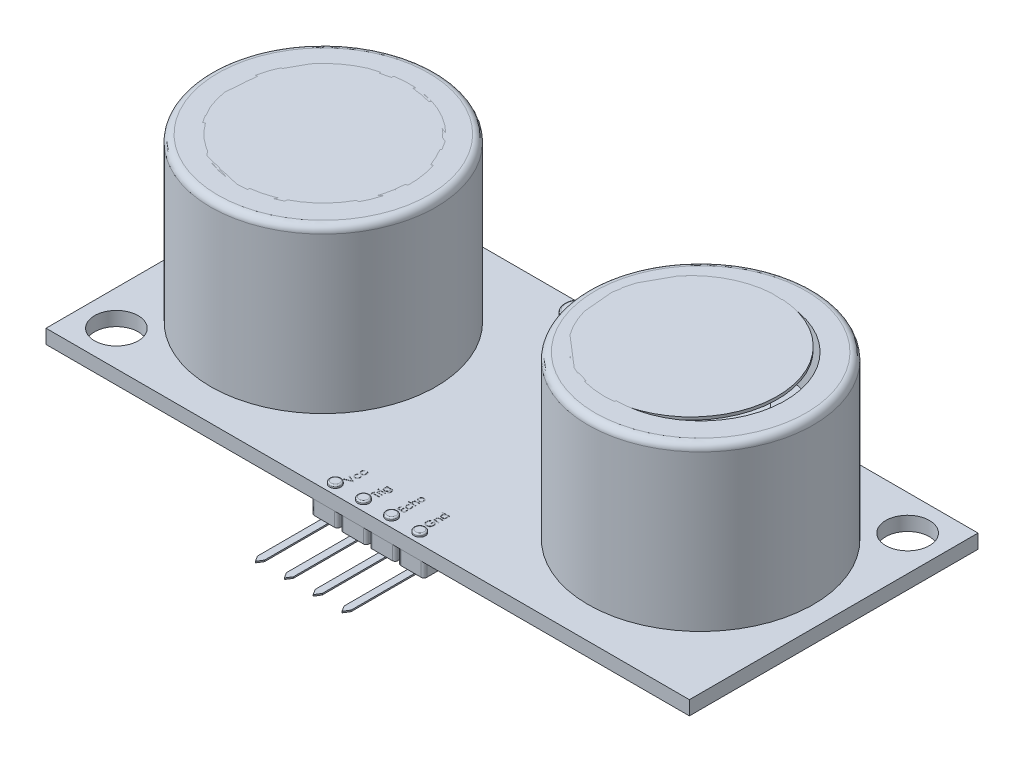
from build123d import *

# Parameters (mm, degrees)
SKETCH1_W              = 45.7
SKETCH1_H              = 20.5
SKETCH1_R              = 1.55
BOSS_EXTRUDE1_DEPTH    = 1
SKETCH2_R              = 8
SKETCH2_R_2            = 6
BOSS_EXTRUDE2_DEPTH    = 11.54
BOSS_EXTRUDE2_2_DEPTH  = 11.54
FILLET1_R              = 0.5
FILLET2_R              = 0.5
SKETCH3_R              = 6
BOSS_EXTRUDE3_DEPTH    = 7
BOSS_EXTRUDE3_2_DEPTH  = 7
LPATTERN2_COUNT        = 2
LPATTERN2_PITCH        = 25.4
SKETCH6_R              = 6.15
BOSS_EXTRUDE4_DEPTH    = 0.2
BOSS_EXTRUDE4_2_DEPTH  = 0.2
BOSS_EXTRUDE10_DEPTH   = 1
BOSS_EXTRUDE10_2_DEPTH = 1
BOSS_EXTRUDE10_3_DEPTH = 1
BOSS_EXTRUDE10_4_DEPTH = 1
SKETCH13_R             = 0.4
BOSS_EXTRUDE8_DEPTH    = 0.2
BOSS_EXTRUDE8_2_DEPTH  = 0.2
BOSS_EXTRUDE8_3_DEPTH  = 0.2
BOSS_EXTRUDE8_4_DEPTH  = 0.2
FILLET3_R              = 0.1
FILLET4_R              = 0.1
FILLET5_R              = 0.1
FILLET6_R              = 0.1
SKETCH15_W             = 0.365384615
SKETCH15_H             = 0.044871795
CUT_EXTRUDE5_DEPTH     = 0.01
BOSS_EXTRUDE11_DEPTH   = 0.1
BOSS_EXTRUDE11_2_DEPTH = 0.1
BOSS_EXTRUDE11_3_DEPTH = 0.1
BOSS_EXTRUDE11_4_DEPTH = 0.1
BOSS_EXTRUDE13_DEPTH   = 0.5
BOSS_EXTRUDE14_DEPTH   = 1.5
FILLET7_R              = 0.1


with BuildPart() as part:
    # Sketch1 → Boss-Extrude1 (new body)
    with BuildSketch(Plane(origin=(0, 0, 0), x_dir=(1, 0, 0), z_dir=(0, 1, 0))):
        Rectangle(SKETCH1_W, SKETCH1_H)
        with Locations(Location((20.35, 7.75, 0), (0, 0, 270))):
            Circle(SKETCH1_R, mode=Mode.SUBTRACT)
        with Locations(Location((-20.35, -7.75, 0), (0, 0, 270))):
            Circle(SKETCH1_R, mode=Mode.SUBTRACT)
    extrude(amount=BOSS_EXTRUDE1_DEPTH)

    # Sketch15 → Cut-Extrude5 (cut)
    # profile 1 of 15: a face of its own
    with BuildSketch(Plane(origin=(0, 1, 0), x_dir=(1, 0, 0), z_dir=(0, 1, 0))):
        with BuildLine():
            Line((-2.771008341, -7.673076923), (-2.747671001, -7.710637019))
            add(Edge.make_bspline(
                [(-2.747671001, -7.710637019), (-2.752789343, -7.714755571), (-2.76286393, -7.722862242), (-2.775865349, -7.736939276), (-2.787032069, -7.751940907), (-2.796132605, -7.768123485), (-2.803164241, -7.785464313), (-2.808139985, -7.803895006), (-2.811240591, -7.823412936), (-2.811592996, -7.836793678), (-2.811773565, -7.84364984)],
                knots=[0, 0, 0, 0, 1.026593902, 2.0206758, 2.988051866, 3.946915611, 4.916868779, 5.907761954, 6.927957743, 8, 8, 8, 8], degree=3))
            add(Edge.make_bspline(
                [(-2.811773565, -7.84364984), (-2.811622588, -7.849129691), (-2.811325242, -7.859922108), (-2.8094666, -7.875765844), (-2.80608917, -7.890857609), (-2.801639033, -7.905291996), (-2.795674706, -7.918966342), (-2.78841617, -7.931916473), (-2.779980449, -7.944257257), (-2.770207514, -7.955631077), (-2.759579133, -7.966035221), (-2.748185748, -7.975049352), (-2.736368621, -7.982897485), (-2.723832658, -7.989055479), (-2.71086465, -7.994094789), (-2.697219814, -7.997410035), (-2.683072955, -7.999619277), (-2.673427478, -7.999872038), (-2.668544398, -8)],
                knots=[0, 0, 0, 0, 1.112346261, 2.190735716, 3.231507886, 4.247384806, 5.251966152, 6.253067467, 7.256802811, 8.280671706, 9.291813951, 10.270744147, 11.225547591, 12.165006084, 13.100104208, 14.043489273, 15.009504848, 16, 16, 16, 16], degree=3))
            add(Edge.make_bspline(
                [(-2.668544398, -8), (-2.662149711, -7.999741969), (-2.649413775, -7.999228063), (-2.630645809, -7.995319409), (-2.612533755, -7.988779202), (-2.595175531, -7.979943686), (-2.579092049, -7.968728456), (-2.564665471, -7.955562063), (-2.552177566, -7.940430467), (-2.541824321, -7.923468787), (-2.533501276, -7.905074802), (-2.527571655, -7.88544765), (-2.523992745, -7.86474768), (-2.523541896, -7.850575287), (-2.523312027, -7.843349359)],
                knots=[0, 0, 0, 0, 0.96628757, 1.924499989, 2.884001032, 3.87047137, 4.860396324, 5.839257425, 6.814467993, 7.816059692, 8.834901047, 9.858382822, 10.908076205, 12, 12, 12, 12], degree=3))
            add(Edge.make_bspline(
                [(-2.523312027, -7.843349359), (-2.523497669, -7.83672719), (-2.523862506, -7.82371287), (-2.526938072, -7.804688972), (-2.531972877, -7.786577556), (-2.53899397, -7.769379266), (-2.548069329, -7.753125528), (-2.559263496, -7.73792136), (-2.572254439, -7.723464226), (-2.582299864, -7.714964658), (-2.587414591, -7.710637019)],
                knots=[0, 0, 0, 0, 1.039848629, 2.043578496, 3.018386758, 3.987534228, 4.954977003, 5.934852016, 6.948509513, 8, 8, 8, 8], degree=3))
            Line((-2.587414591, -7.710637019), (-2.562775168, -7.673076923))
            add(Edge.make_bspline(
                [(-2.562775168, -7.673076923), (-2.559505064, -7.675303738), (-2.55297571, -7.679749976), (-2.543769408, -7.687182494), (-2.535152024, -7.695199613), (-2.527135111, -7.703770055), (-2.519526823, -7.712781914), (-2.512690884, -7.722543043), (-2.506243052, -7.732738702), (-2.500441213, -7.743488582), (-2.495226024, -7.754681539), (-2.490741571, -7.766301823), (-2.486888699, -7.778298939), (-2.483826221, -7.790686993), (-2.481381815, -7.803490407), (-2.479759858, -7.816676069), (-2.478549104, -7.830239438), (-2.478476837, -7.839406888), (-2.478440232, -7.844050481)],
                knots=[0, 0, 0, 0, 0.954134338, 1.905101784, 2.851144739, 3.791306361, 4.734911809, 5.6936923, 6.663572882, 7.643865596, 8.638447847, 9.640600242, 10.646758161, 11.676244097, 12.717260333, 13.78922464, 14.880174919, 16, 16, 16, 16], degree=3))
            add(Edge.make_bspline(
                [(-2.478440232, -7.844050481), (-2.478567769, -7.851137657), (-2.478817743, -7.865028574), (-2.481558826, -7.885361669), (-2.485706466, -7.904787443), (-2.491608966, -7.923340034), (-2.499403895, -7.940906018), (-2.508707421, -7.957631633), (-2.519826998, -7.973344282), (-2.532498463, -7.987940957), (-2.546251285, -8.001289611), (-2.561005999, -8.01290504), (-2.576436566, -8.022748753), (-2.592640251, -8.030857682), (-2.60955061, -8.037198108), (-2.627270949, -8.041563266), (-2.645650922, -8.044379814), (-2.658184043, -8.044706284), (-2.664537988, -8.044871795)],
                knots=[0, 0, 0, 0, 1.113096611, 2.181677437, 3.217994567, 4.231807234, 5.234933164, 6.233258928, 7.234764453, 8.254006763, 9.267004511, 10.242118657, 11.199842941, 12.138404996, 13.084707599, 14.031460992, 15.002005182, 16, 16, 16, 16], degree=3))
            add(Edge.make_bspline(
                [(-2.664537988, -8.044871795), (-2.668849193, -8.044808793), (-2.677424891, -8.044683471), (-2.690152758, -8.043246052), (-2.702711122, -8.041389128), (-2.714940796, -8.038242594), (-2.727027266, -8.034608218), (-2.738824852, -8.029968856), (-2.750388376, -8.024526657), (-2.761688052, -8.018347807), (-2.772537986, -8.011392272), (-2.78278851, -8.003694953), (-2.792562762, -7.995545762), (-2.801523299, -7.986563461), (-2.810028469, -7.977129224), (-2.817851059, -7.966976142), (-2.825014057, -7.956162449), (-2.831649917, -7.944850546), (-2.837558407, -7.933047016), (-2.84264887, -7.920823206), (-2.846999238, -7.908252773), (-2.850443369, -7.895315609), (-2.853331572, -7.882097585), (-2.855148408, -7.868494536), (-2.856432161, -7.854558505), (-2.856573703, -7.84512193), (-2.85664536, -7.840344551)],
                knots=[0, 0, 0, 0, 0.990994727, 1.971252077, 2.943264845, 3.907940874, 4.872158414, 5.844625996, 6.82015047, 7.809835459, 8.804511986, 9.781214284, 10.756496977, 11.728388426, 12.696359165, 13.676225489, 14.672885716, 15.677705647, 16.690706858, 17.706033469, 18.721040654, 19.747369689, 20.783475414, 21.830280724, 22.901553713, 24, 24, 24, 24], degree=3))
            add(Edge.make_bspline(
                [(-2.85664536, -7.840344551), (-2.856513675, -7.834361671), (-2.856250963, -7.822425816), (-2.854039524, -7.804720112), (-2.850706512, -7.787274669), (-2.84576471, -7.770398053), (-2.839794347, -7.754285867), (-2.833049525, -7.739243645), (-2.825383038, -7.725498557), (-2.816841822, -7.712929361), (-2.807112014, -7.701539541), (-2.796292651, -7.691037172), (-2.784305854, -7.681353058), (-2.775477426, -7.675858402), (-2.771008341, -7.673076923)],
                knots=[0, 0, 0, 0, 1.095139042, 2.184804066, 3.262657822, 4.34424993, 5.400369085, 6.407210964, 7.359649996, 8.278719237, 9.185177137, 10.097389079, 11.036869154, 12, 12, 12, 12], degree=3))
        make_face()
    # profile 2 of 15: a face of its own
    with BuildSketch(Plane(origin=(0, 1, 0), x_dir=(1, 0, 0), z_dir=(0, 1, 0))):
        with BuildLine():
            Line((-2.771008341, -8.121794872), (-2.747671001, -8.159354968))
            add(Edge.make_bspline(
                [(-2.747671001, -8.159354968), (-2.752789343, -8.16347352), (-2.76286393, -8.171580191), (-2.775865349, -8.185657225), (-2.787032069, -8.200658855), (-2.796132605, -8.216841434), (-2.803164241, -8.234182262), (-2.808139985, -8.252612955), (-2.811240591, -8.272130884), (-2.811592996, -8.285511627), (-2.811773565, -8.292367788)],
                knots=[0, 0, 0, 0, 1.026593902, 2.0206758, 2.988051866, 3.946915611, 4.916868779, 5.907761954, 6.927957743, 8, 8, 8, 8], degree=3))
            add(Edge.make_bspline(
                [(-2.811773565, -8.292367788), (-2.811622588, -8.297847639), (-2.811325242, -8.308640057), (-2.8094666, -8.324483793), (-2.80608917, -8.339575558), (-2.801639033, -8.354009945), (-2.795674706, -8.36768429), (-2.78841617, -8.380634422), (-2.779980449, -8.392975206), (-2.770207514, -8.404349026), (-2.759579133, -8.41475317), (-2.748185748, -8.423767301), (-2.736368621, -8.431615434), (-2.723832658, -8.437773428), (-2.71086465, -8.442812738), (-2.697219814, -8.446127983), (-2.683072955, -8.448337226), (-2.673427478, -8.448589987), (-2.668544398, -8.448717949)],
                knots=[0, 0, 0, 0, 1.112346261, 2.190735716, 3.231507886, 4.247384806, 5.251966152, 6.253067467, 7.256802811, 8.280671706, 9.291813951, 10.270744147, 11.225547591, 12.165006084, 13.100104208, 14.043489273, 15.009504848, 16, 16, 16, 16], degree=3))
            add(Edge.make_bspline(
                [(-2.668544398, -8.448717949), (-2.662149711, -8.448459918), (-2.649413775, -8.447946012), (-2.630645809, -8.444037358), (-2.612533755, -8.437497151), (-2.595175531, -8.428661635), (-2.579092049, -8.417446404), (-2.564665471, -8.404280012), (-2.552177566, -8.389148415), (-2.541824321, -8.372186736), (-2.533501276, -8.35379275), (-2.527571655, -8.334165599), (-2.523992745, -8.313465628), (-2.523541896, -8.299293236), (-2.523312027, -8.292067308)],
                knots=[0, 0, 0, 0, 0.96628757, 1.924499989, 2.884001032, 3.87047137, 4.860396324, 5.839257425, 6.814467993, 7.816059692, 8.834901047, 9.858382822, 10.908076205, 12, 12, 12, 12], degree=3))
            add(Edge.make_bspline(
                [(-2.523312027, -8.292067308), (-2.523497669, -8.285445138), (-2.523862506, -8.272430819), (-2.526938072, -8.253406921), (-2.531972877, -8.235295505), (-2.53899397, -8.218097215), (-2.548069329, -8.201843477), (-2.559263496, -8.186639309), (-2.572254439, -8.172182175), (-2.582299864, -8.163682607), (-2.587414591, -8.159354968)],
                knots=[0, 0, 0, 0, 1.039848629, 2.043578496, 3.018386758, 3.987534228, 4.954977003, 5.934852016, 6.948509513, 8, 8, 8, 8], degree=3))
            Line((-2.587414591, -8.159354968), (-2.562775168, -8.121794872))
            add(Edge.make_bspline(
                [(-2.562775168, -8.121794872), (-2.559505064, -8.124021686), (-2.55297571, -8.128467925), (-2.543769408, -8.135900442), (-2.535152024, -8.143917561), (-2.527135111, -8.152488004), (-2.519526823, -8.161499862), (-2.512690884, -8.171260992), (-2.506243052, -8.181456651), (-2.500441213, -8.192206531), (-2.495226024, -8.203399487), (-2.490741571, -8.215019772), (-2.486888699, -8.227016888), (-2.483826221, -8.239404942), (-2.481381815, -8.252208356), (-2.479759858, -8.265394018), (-2.478549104, -8.278957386), (-2.478476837, -8.288124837), (-2.478440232, -8.292768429)],
                knots=[0, 0, 0, 0, 0.954134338, 1.905101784, 2.851144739, 3.791306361, 4.734911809, 5.6936923, 6.663572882, 7.643865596, 8.638447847, 9.640600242, 10.646758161, 11.676244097, 12.717260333, 13.78922464, 14.880174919, 16, 16, 16, 16], degree=3))
            add(Edge.make_bspline(
                [(-2.478440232, -8.292768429), (-2.478567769, -8.299855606), (-2.478817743, -8.313746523), (-2.481558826, -8.334079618), (-2.485706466, -8.353505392), (-2.491608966, -8.372057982), (-2.499403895, -8.389623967), (-2.508707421, -8.406349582), (-2.519826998, -8.42206223), (-2.532498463, -8.436658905), (-2.546251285, -8.45000756), (-2.561005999, -8.461622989), (-2.576436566, -8.471466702), (-2.592640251, -8.479575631), (-2.60955061, -8.485916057), (-2.627270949, -8.490281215), (-2.645650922, -8.493097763), (-2.658184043, -8.493424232), (-2.664537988, -8.493589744)],
                knots=[0, 0, 0, 0, 1.113096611, 2.181677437, 3.217994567, 4.231807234, 5.234933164, 6.233258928, 7.234764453, 8.254006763, 9.267004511, 10.242118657, 11.199842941, 12.138404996, 13.084707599, 14.031460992, 15.002005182, 16, 16, 16, 16], degree=3))
            add(Edge.make_bspline(
                [(-2.664537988, -8.493589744), (-2.668849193, -8.493526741), (-2.677424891, -8.493401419), (-2.690152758, -8.491964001), (-2.702711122, -8.490107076), (-2.714940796, -8.486960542), (-2.727027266, -8.483326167), (-2.738824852, -8.478686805), (-2.750388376, -8.473244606), (-2.761688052, -8.467065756), (-2.772537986, -8.460110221), (-2.78278851, -8.452412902), (-2.792562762, -8.444263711), (-2.801523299, -8.435281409), (-2.810028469, -8.425847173), (-2.817851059, -8.415694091), (-2.825014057, -8.404880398), (-2.831649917, -8.393568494), (-2.837558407, -8.381764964), (-2.84264887, -8.369541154), (-2.846999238, -8.356970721), (-2.850443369, -8.344033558), (-2.853331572, -8.330815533), (-2.855148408, -8.317212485), (-2.856432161, -8.303276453), (-2.856573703, -8.293839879), (-2.85664536, -8.2890625)],
                knots=[0, 0, 0, 0, 0.990994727, 1.971252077, 2.943264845, 3.907940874, 4.872158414, 5.844625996, 6.82015047, 7.809835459, 8.804511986, 9.781214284, 10.756496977, 11.728388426, 12.696359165, 13.676225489, 14.672885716, 15.677705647, 16.690706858, 17.706033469, 18.721040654, 19.747369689, 20.783475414, 21.830280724, 22.901553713, 24, 24, 24, 24], degree=3))
            add(Edge.make_bspline(
                [(-2.85664536, -8.2890625), (-2.856513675, -8.28307962), (-2.856250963, -8.271143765), (-2.854039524, -8.25343806), (-2.850706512, -8.235992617), (-2.84576471, -8.219116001), (-2.839794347, -8.203003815), (-2.833049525, -8.187961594), (-2.825383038, -8.174216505), (-2.816841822, -8.161647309), (-2.807112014, -8.150257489), (-2.796292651, -8.139755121), (-2.784305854, -8.130071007), (-2.775477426, -8.124576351), (-2.771008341, -8.121794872)],
                knots=[0, 0, 0, 0, 1.095139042, 2.184804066, 3.262657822, 4.34424993, 5.400369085, 6.407210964, 7.359649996, 8.278719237, 9.185177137, 10.097389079, 11.036869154, 12, 12, 12, 12], degree=3))
        make_face()
    # profile 3 of 15: a face of its own
    with BuildSketch(Plane(origin=(0, 1, 0), x_dir=(1, 0, 0), z_dir=(0, 1, 0))):
        Polygon((-2.984850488, -8.993589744), (-2.984850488, -8.945512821), (-2.590820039, -8.778846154), (-2.984850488, -8.612179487), (-2.984850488, -8.564102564), (-2.484850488, -8.775641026), (-2.484850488, -8.782051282), align=None)
    # profile 4 of 15: a face of its own
    with BuildSketch(Plane(origin=(0, 1, 0), x_dir=(1, 0, 0), z_dir=(0, 1, 0))):
        with BuildLine():
            Line((-0.997671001, -7.923076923), (-0.997671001, -7.878205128))
            Line((-0.997671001, -7.878205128), (-0.707707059, -7.878205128))
            add(Edge.make_bspline(
                [(-0.707707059, -7.878205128), (-0.701530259, -7.878244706), (-0.689607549, -7.8783211), (-0.672367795, -7.878871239), (-0.656444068, -7.880031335), (-0.641763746, -7.881346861), (-0.628394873, -7.883239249), (-0.616297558, -7.885550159), (-0.605460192, -7.888155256), (-0.598785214, -7.890443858), (-0.595627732, -7.891526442)],
                knots=[0, 0, 0, 0, 1.307562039, 2.523909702, 3.650326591, 4.686913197, 5.643429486, 6.506965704, 7.293745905, 8, 8, 8, 8], degree=3))
            add(Edge.make_bspline(
                [(-0.595627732, -7.891526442), (-0.591523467, -7.893124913), (-0.583437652, -7.89627406), (-0.571975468, -7.902171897), (-0.561183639, -7.908777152), (-0.551119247, -7.916319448), (-0.54184421, -7.924773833), (-0.533128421, -7.933892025), (-0.525299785, -7.943993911), (-0.518264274, -7.954902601), (-0.511803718, -7.966397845), (-0.50629187, -7.978566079), (-0.501694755, -7.991341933), (-0.497912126, -8.004666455), (-0.494860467, -8.018538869), (-0.492824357, -8.033005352), (-0.49145333, -8.048017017), (-0.491325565, -8.058223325), (-0.491260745, -8.063401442)],
                knots=[0, 0, 0, 0, 0.98202571, 1.934689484, 2.871054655, 3.802072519, 4.735470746, 5.668036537, 6.612630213, 7.581518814, 8.561763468, 9.551722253, 10.55777311, 11.588015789, 12.63986657, 13.723744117, 14.845153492, 16, 16, 16, 16], degree=3))
            add(Edge.make_bspline(
                [(-0.491260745, -8.063401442), (-0.491398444, -8.070954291), (-0.491667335, -8.085703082), (-0.494237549, -8.107250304), (-0.498383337, -8.127647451), (-0.504290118, -8.146745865), (-0.51159439, -8.164353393), (-0.519961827, -8.180371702), (-0.529561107, -8.194653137), (-0.540489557, -8.207527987), (-0.553484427, -8.219148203), (-0.56879853, -8.230080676), (-0.586665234, -8.240603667), (-0.599778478, -8.246770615), (-0.60664536, -8.25)],
                knots=[0, 0, 0, 0, 1.157856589, 2.260999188, 3.322382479, 4.345906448, 5.321474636, 6.242187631, 7.112686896, 7.955149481, 8.825136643, 9.778649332, 10.836767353, 12, 12, 12, 12], degree=3))
            Line((-0.60664536, -8.25), (-0.60664536, -8.205128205))
            add(Edge.make_bspline(
                [(-0.60664536, -8.205128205), (-0.600917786, -8.201517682), (-0.589721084, -8.194459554), (-0.575209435, -8.181304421), (-0.562921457, -8.166781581), (-0.552951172, -8.15058289), (-0.545275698, -8.13259537), (-0.539944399, -8.112702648), (-0.536718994, -8.090850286), (-0.536333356, -8.075632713), (-0.536132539, -8.067708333)],
                knots=[0, 0, 0, 0, 0.997887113, 1.950746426, 2.877762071, 3.798308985, 4.747694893, 5.754452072, 6.830656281, 8, 8, 8, 8], degree=3))
            add(Edge.make_bspline(
                [(-0.536132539, -8.067708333), (-0.536335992, -8.059884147), (-0.536728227, -8.0447999), (-0.53994568, -8.023114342), (-0.545277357, -8.003286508), (-0.552935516, -7.98553539), (-0.562134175, -7.969971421), (-0.57230764, -7.956477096), (-0.583915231, -7.945633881), (-0.594592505, -7.938312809), (-0.604111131, -7.933766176), (-0.61230383, -7.930868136), (-0.621538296, -7.928530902), (-0.631836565, -7.926524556), (-0.643202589, -7.924934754), (-0.65567513, -7.923891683), (-0.669169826, -7.923151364), (-0.678525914, -7.92310231), (-0.683368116, -7.923076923)],
                knots=[0, 0, 0, 0, 1.570880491, 3.028500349, 4.391799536, 5.683507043, 6.897971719, 8.016608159, 9.065046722, 10.074948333, 10.602832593, 11.179761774, 11.817338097, 12.514350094, 13.286299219, 14.121078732, 15.027572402, 16, 16, 16, 16], degree=3))
            Line((-0.683368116, -7.923076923), (-0.702298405, -7.923076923))
            add(Edge.make_bspline(
                [(-0.702298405, -7.923076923), (-0.696880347, -7.927632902), (-0.686139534, -7.936664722), (-0.672040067, -7.9522204), (-0.660043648, -7.969318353), (-0.650065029, -7.987716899), (-0.642159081, -8.007141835), (-0.636430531, -8.027249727), (-0.632877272, -8.047984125), (-0.632484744, -8.062018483), (-0.632286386, -8.069110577)],
                knots=[0, 0, 0, 0, 1.012670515, 2.007528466, 2.995541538, 3.996581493, 4.997861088, 5.991949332, 6.98525577, 8, 8, 8, 8], degree=3))
            add(Edge.make_bspline(
                [(-0.632286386, -8.069110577), (-0.632374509, -8.073285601), (-0.632549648, -8.081583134), (-0.63361503, -8.093945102), (-0.635689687, -8.106068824), (-0.638346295, -8.11803153), (-0.641907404, -8.129749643), (-0.646087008, -8.14136357), (-0.651220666, -8.152704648), (-0.657000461, -8.163830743), (-0.663494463, -8.174480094), (-0.670510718, -8.184619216), (-0.67803427, -8.194185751), (-0.686133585, -8.203091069), (-0.694798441, -8.211322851), (-0.703936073, -8.218991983), (-0.713674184, -8.225971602), (-0.723835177, -8.232404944), (-0.734486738, -8.237984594), (-0.745397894, -8.242882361), (-0.756545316, -8.247140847), (-0.767966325, -8.250535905), (-0.779653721, -8.253128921), (-0.791588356, -8.255058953), (-0.803806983, -8.256153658), (-0.812038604, -8.256324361), (-0.816180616, -8.256410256)],
                knots=[0, 0, 0, 0, 1.028710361, 2.044481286, 3.053267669, 4.056977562, 5.061496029, 6.068537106, 7.095799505, 8.125955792, 9.155750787, 10.166547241, 11.162135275, 12.151998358, 13.129411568, 14.10464185, 15.088574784, 16.079052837, 17.065149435, 18.048153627, 19.024354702, 20.002874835, 20.980703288, 21.971932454, 22.97951087, 24, 24, 24, 24], degree=3))
            add(Edge.make_bspline(
                [(-0.816180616, -8.256410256), (-0.820323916, -8.25633609), (-0.828594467, -8.256188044), (-0.840862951, -8.254909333), (-0.852967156, -8.253085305), (-0.864782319, -8.250198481), (-0.876442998, -8.246723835), (-0.887863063, -8.242420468), (-0.899045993, -8.237246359), (-0.910000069, -8.231387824), (-0.920578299, -8.224804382), (-0.930624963, -8.217585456), (-0.94006613, -8.209722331), (-0.948997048, -8.201323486), (-0.957331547, -8.192286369), (-0.965049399, -8.182615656), (-0.972279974, -8.172406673), (-0.978867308, -8.16162778), (-0.984693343, -8.150445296), (-0.990009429, -8.139143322), (-0.994228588, -8.127572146), (-0.997946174, -8.115947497), (-1.000579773, -8.104064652), (-1.002611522, -8.09206931), (-1.003849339, -8.079920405), (-1.004003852, -8.071784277), (-1.004081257, -8.067708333)],
                knots=[0, 0, 0, 0, 1.008818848, 2.013730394, 3.001654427, 3.987803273, 4.973046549, 5.963777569, 6.957074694, 7.972068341, 8.987420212, 9.989399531, 10.982630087, 11.977756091, 12.973280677, 13.973972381, 14.989194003, 16.018387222, 17.047741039, 18.059210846, 19.057554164, 20.045176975, 21.029480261, 22.018708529, 23.007435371, 24, 24, 24, 24], degree=3))
            add(Edge.make_bspline(
                [(-1.004081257, -8.067708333), (-1.003887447, -8.060986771), (-1.003504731, -8.04771375), (-1.00050171, -8.028180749), (-0.995713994, -8.009331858), (-0.988854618, -7.991060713), (-0.979490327, -7.973218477), (-0.96715562, -7.955863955), (-0.951739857, -7.938946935), (-0.939918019, -7.928507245), (-0.933768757, -7.923076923)],
                knots=[0, 0, 0, 0, 0.96728863, 1.910097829, 2.838038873, 3.762875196, 4.71315279, 5.730631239, 6.819562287, 8, 8, 8, 8], degree=3))
            Line((-0.933768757, -7.923076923), (-0.997671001, -7.923076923))
        make_face()
        with BuildLine():
            add(Edge.make_bspline(
                [(-0.959209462, -8.064102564), (-0.958985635, -8.070663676), (-0.958542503, -8.083653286), (-0.954785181, -8.102700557), (-0.948838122, -8.121046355), (-0.940560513, -8.138509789), (-0.930099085, -8.15468857), (-0.917652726, -8.169167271), (-0.903392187, -8.181790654), (-0.887501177, -8.192471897), (-0.87033042, -8.201004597), (-0.852239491, -8.206965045), (-0.83354441, -8.210904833), (-0.820807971, -8.211325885), (-0.814377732, -8.211538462)],
                knots=[0, 0, 0, 0, 1.026191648, 2.031641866, 3.026511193, 4.038688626, 5.047555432, 6.033268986, 7.01798463, 8.019529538, 9.022150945, 10.008736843, 10.994672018, 12, 12, 12, 12], degree=3))
            add(Edge.make_bspline(
                [(-0.814377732, -8.211538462), (-0.809530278, -8.211434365), (-0.799996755, -8.211229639), (-0.786003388, -8.209275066), (-0.772655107, -8.206077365), (-0.759964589, -8.201659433), (-0.747930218, -8.19601418), (-0.736552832, -8.189051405), (-0.725826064, -8.18080999), (-0.71584043, -8.171403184), (-0.70674619, -8.161034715), (-0.698754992, -8.149789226), (-0.692219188, -8.137681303), (-0.686570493, -8.12500891), (-0.682444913, -8.111464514), (-0.679296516, -8.097243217), (-0.677495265, -8.082244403), (-0.677272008, -8.072019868), (-0.67715818, -8.066806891)],
                knots=[0, 0, 0, 0, 1.039710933, 2.044807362, 3.024849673, 3.981007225, 4.923240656, 5.871799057, 6.837597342, 7.820855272, 8.810901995, 9.792827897, 10.773995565, 11.758948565, 12.765014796, 13.806304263, 14.881544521, 16, 16, 16, 16], degree=3))
            add(Edge.make_bspline(
                [(-0.67715818, -8.066806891), (-0.677267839, -8.061526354), (-0.677482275, -8.05120032), (-0.679325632, -8.036118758), (-0.6823002, -8.021828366), (-0.686523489, -8.008342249), (-0.691912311, -7.995609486), (-0.698731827, -7.983773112), (-0.706498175, -7.972579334), (-0.715557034, -7.962385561), (-0.725540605, -7.953167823), (-0.736404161, -7.945134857), (-0.747984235, -7.938289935), (-0.760279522, -7.932621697), (-0.773385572, -7.928294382), (-0.787269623, -7.925391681), (-0.801865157, -7.923362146), (-0.811866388, -7.923173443), (-0.816981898, -7.923076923)],
                knots=[0, 0, 0, 0, 1.121943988, 2.193949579, 3.223793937, 4.220241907, 5.192961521, 6.155822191, 7.11847367, 8.083710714, 9.04790392, 10.001595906, 10.949595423, 11.902125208, 12.873731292, 13.87582262, 14.913508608, 16, 16, 16, 16], degree=3))
            add(Edge.make_bspline(
                [(-0.816981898, -7.923076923), (-0.82364145, -7.923268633), (-0.836651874, -7.923643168), (-0.85561197, -7.927166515), (-0.873457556, -7.93288198), (-0.890142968, -7.94081413), (-0.905435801, -7.950799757), (-0.918948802, -7.962944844), (-0.931054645, -7.976711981), (-0.941008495, -7.992437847), (-0.949122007, -8.009269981), (-0.955011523, -8.026960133), (-0.958478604, -8.045337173), (-0.958964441, -8.057811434), (-0.959209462, -8.064102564)],
                knots=[0, 0, 0, 0, 1.070678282, 2.091729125, 3.090678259, 4.078281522, 5.055707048, 6.018451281, 6.993304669, 7.996175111, 9.002951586, 9.993356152, 10.987991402, 12, 12, 12, 12], degree=3))
        make_face(mode=Mode.SUBTRACT)
    # profile 5 of 15: a face of its own
    with BuildSketch(Plane(origin=(0, 1, 0), x_dir=(1, 0, 0), z_dir=(0, 1, 0))):
        with BuildLine():
            add(Edge.make_bspline(
                [(-1.151517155, -8.368790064), (-1.15138799, -8.36600559), (-1.151135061, -8.360553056), (-1.148969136, -8.352668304), (-1.145297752, -8.34548873), (-1.140372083, -8.339120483), (-1.134579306, -8.333655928), (-1.127827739, -8.329830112), (-1.120533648, -8.327371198), (-1.115445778, -8.327074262), (-1.112855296, -8.326923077)],
                knots=[0, 0, 0, 0, 1.055194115, 2.066272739, 3.074728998, 4.095836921, 5.109056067, 6.073838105, 7.019297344, 8, 8, 8, 8], degree=3))
            add(Edge.make_bspline(
                [(-1.112855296, -8.326923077), (-1.11033206, -8.327077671), (-1.10534392, -8.327383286), (-1.098176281, -8.329828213), (-1.091518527, -8.333688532), (-1.085736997, -8.339116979), (-1.080814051, -8.345489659), (-1.077141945, -8.352668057), (-1.074976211, -8.360553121), (-1.074723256, -8.366005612), (-1.074594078, -8.368790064)],
                knots=[0, 0, 0, 0, 0.96129708, 1.900370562, 2.859976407, 3.87933698, 4.906634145, 5.921202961, 6.938410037, 8, 8, 8, 8], degree=3))
            add(Edge.make_bspline(
                [(-1.074594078, -8.368790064), (-1.074718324, -8.371542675), (-1.074960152, -8.376900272), (-1.07718444, -8.384666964), (-1.080815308, -8.391785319), (-1.085704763, -8.398165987), (-1.091554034, -8.403484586), (-1.098172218, -8.407355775), (-1.105344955, -8.409795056), (-1.110332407, -8.410101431), (-1.112855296, -8.41025641)],
                knots=[0, 0, 0, 0, 1.054934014, 2.053291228, 3.073705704, 4.106921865, 5.123545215, 6.088680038, 7.033164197, 8, 8, 8, 8], degree=3))
            add(Edge.make_bspline(
                [(-1.112855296, -8.41025641), (-1.115445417, -8.410104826), (-1.120532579, -8.409807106), (-1.127831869, -8.407353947), (-1.134543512, -8.403516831), (-1.140404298, -8.398162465), (-1.145296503, -8.391786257), (-1.148926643, -8.384666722), (-1.15115112, -8.376900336), (-1.151392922, -8.371542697), (-1.151517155, -8.368790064)],
                knots=[0, 0, 0, 0, 0.98631895, 1.937192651, 2.907499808, 3.917963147, 4.944918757, 5.95915025, 6.951458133, 8, 8, 8, 8], degree=3))
        make_face()
    # profile 6 of 15: a face of its own
    with BuildSketch(Plane(origin=(0, 1, 0), x_dir=(1, 0, 0), z_dir=(0, 1, 0))):
        with Locations((-0.814978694, -8.368589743)):
            Rectangle(SKETCH15_W, SKETCH15_H)
    # profile 7 of 15: a face of its own
    with BuildSketch(Plane(origin=(0, 1, 0), x_dir=(1, 0, 0), z_dir=(0, 1, 0))):
        with BuildLine():
            Line((-0.997671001, -8.608974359), (-0.997671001, -8.564102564))
            Line((-0.997671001, -8.564102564), (-0.943884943, -8.564102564))
            add(Edge.make_bspline(
                [(-0.943884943, -8.564102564), (-0.948895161, -8.560792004), (-0.958477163, -8.554460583), (-0.971132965, -8.543887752), (-0.98173113, -8.533173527), (-0.990069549, -8.522036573), (-0.996371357, -8.510586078), (-1.00079944, -8.498918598), (-1.003545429, -8.487005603), (-1.003902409, -8.478980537), (-1.004081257, -8.474959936)],
                knots=[0, 0, 0, 0, 1.280091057, 2.448164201, 3.510831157, 4.48793739, 5.405868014, 6.289422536, 7.142991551, 8, 8, 8, 8], degree=3))
            add(Edge.make_bspline(
                [(-1.004081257, -8.474959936), (-1.003911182, -8.471841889), (-1.003561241, -8.465426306), (-1.001102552, -8.455714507), (-0.99717712, -8.4457083), (-0.99348566, -8.439259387), (-0.991561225, -8.435897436)],
                knots=[0, 0, 0, 0, 0.901110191, 1.854092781, 2.881294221, 4, 4, 4, 4], degree=3))
            Line((-0.991561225, -8.435897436), (-0.952699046, -8.460536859))
            add(Edge.make_bspline(
                [(-0.952699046, -8.460536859), (-0.953661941, -8.462695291), (-0.9554897, -8.466792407), (-0.957652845, -8.472785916), (-0.958926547, -8.478311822), (-0.959119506, -8.48183233), (-0.959209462, -8.483473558)],
                knots=[0, 0, 0, 0, 1.180555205, 2.24091978, 3.179933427, 4, 4, 4, 4], degree=3))
            add(Edge.make_bspline(
                [(-0.959209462, -8.483473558), (-0.958971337, -8.487075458), (-0.958485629, -8.49442229), (-0.954612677, -8.505172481), (-0.948535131, -8.515697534), (-0.941614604, -8.523975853), (-0.934966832, -8.530408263), (-0.929148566, -8.535034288), (-0.922564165, -8.539186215), (-0.915468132, -8.543213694), (-0.907682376, -8.546955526), (-0.899194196, -8.550299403), (-0.890073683, -8.553426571), (-0.883731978, -8.555187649), (-0.880483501, -8.556089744)],
                knots=[0, 0, 0, 0, 1.125322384, 2.295331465, 3.535939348, 4.916963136, 5.656144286, 6.429838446, 7.238666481, 8.090384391, 8.983239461, 9.940052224, 10.944811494, 12, 12, 12, 12], degree=3))
            add(Edge.make_bspline(
                [(-0.880483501, -8.556089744), (-0.877586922, -8.556766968), (-0.871139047, -8.558274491), (-0.860370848, -8.559701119), (-0.847656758, -8.561167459), (-0.832982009, -8.562168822), (-0.81629019, -8.563114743), (-0.79765331, -8.563637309), (-0.777020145, -8.564085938), (-0.762628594, -8.564096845), (-0.75508286, -8.564102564)],
                knots=[0, 0, 0, 0, 0.566841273, 1.261806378, 2.068780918, 3.007109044, 4.065315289, 5.256255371, 6.561408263, 8, 8, 8, 8], degree=3))
            Line((-0.75508286, -8.564102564), (-0.632286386, -8.564102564))
            Line((-0.632286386, -8.564102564), (-0.632286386, -8.608974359))
            Line((-0.632286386, -8.608974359), (-0.997671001, -8.608974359))
        make_face()
    # profile 8 of 15: a face of its own
    with BuildSketch(Plane(origin=(0, 1, 0), x_dir=(1, 0, 0), z_dir=(0, 1, 0))):
        Polygon((-1.081004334, -8.935897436), (-1.132286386, -8.935897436), (-1.132286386, -8.673076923), (-1.081004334, -8.673076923), (-1.081004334, -8.782051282), (-0.632286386, -8.782051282), (-0.632286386, -8.826923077), (-1.081004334, -8.826923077), align=None)
    # profile 9 of 15: a face of its own
    with BuildSketch(Plane(origin=(0, 1, 0), x_dir=(1, 0, 0), z_dir=(0, 1, 0))):
        with BuildLine():
            add(Edge.make_bspline(
                [(0.848482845, -7.477363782), (0.84862883, -7.470507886), (0.84891507, -7.457065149), (0.85197435, -7.437378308), (0.856652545, -7.418586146), (0.863119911, -7.40061669), (0.871788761, -7.383700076), (0.882132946, -7.367589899), (0.894387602, -7.352330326), (0.903867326, -7.343184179), (0.908679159, -7.338541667)],
                knots=[0, 0, 0, 0, 1.054011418, 2.066658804, 3.057071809, 4.030435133, 4.997543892, 5.974964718, 6.972108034, 8, 8, 8, 8], degree=3))
            add(Edge.make_bspline(
                [(0.908679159, -7.338541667), (0.913281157, -7.334544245), (0.922396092, -7.326626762), (0.937175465, -7.316474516), (0.952481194, -7.307728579), (0.968516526, -7.300719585), (0.985141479, -7.295193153), (1.002413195, -7.291269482), (1.02029353, -7.288935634), (1.032436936, -7.288620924), (1.038587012, -7.288461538)],
                knots=[0, 0, 0, 0, 1.025258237, 2.030674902, 3.01204498, 3.988269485, 4.97094183, 5.956517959, 6.965070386, 8, 8, 8, 8], degree=3))
            add(Edge.make_bspline(
                [(1.038587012, -7.288461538), (1.044772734, -7.28860173), (1.056996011, -7.288878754), (1.074998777, -7.29149927), (1.09245518, -7.29557514), (1.109292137, -7.301408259), (1.125561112, -7.308887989), (1.141191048, -7.31801523), (1.156212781, -7.328854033), (1.170498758, -7.341140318), (1.18366536, -7.354719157), (1.195140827, -7.369450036), (1.204972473, -7.385043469), (1.212891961, -7.401706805), (1.219136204, -7.419287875), (1.223521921, -7.437824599), (1.22617359, -7.45728818), (1.2265141, -7.470577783), (1.226687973, -7.477363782)],
                knots=[0, 0, 0, 0, 0.998656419, 1.973391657, 2.932242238, 3.890759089, 4.846373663, 5.82037756, 6.809684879, 7.83454468, 8.860553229, 9.859544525, 10.845671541, 11.83227036, 12.833544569, 13.85385346, 14.904124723, 16, 16, 16, 16], degree=3))
            add(Edge.make_bspline(
                [(1.226687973, -7.477363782), (1.226513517, -7.484183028), (1.226171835, -7.497538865), (1.223532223, -7.517071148), (1.219138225, -7.535641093), (1.212871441, -7.553245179), (1.20497222, -7.569980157), (1.19517055, -7.585663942), (1.183661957, -7.600406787), (1.17049968, -7.6139885), (1.156212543, -7.626274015), (1.141191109, -7.637113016), (1.125561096, -7.646240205), (1.109292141, -7.653719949), (1.092455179, -7.659553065), (1.074998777, -7.663628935), (1.056996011, -7.666249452), (1.044772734, -7.666526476), (1.038587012, -7.666666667)],
                knots=[0, 0, 0, 0, 1.099876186, 2.154163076, 3.173186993, 4.173200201, 5.163417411, 6.152872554, 7.150605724, 8.17532212, 9.198891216, 10.186952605, 11.159729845, 12.11414092, 13.071450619, 14.029093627, 15.002601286, 16, 16, 16, 16], degree=3))
            add(Edge.make_bspline(
                [(1.038587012, -7.666666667), (1.032470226, -7.666506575), (1.020360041, -7.666189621), (1.002515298, -7.663852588), (0.985296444, -7.65997161), (0.968762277, -7.654368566), (0.952765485, -7.647372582), (0.937403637, -7.638714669), (0.922688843, -7.628464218), (0.913585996, -7.620577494), (0.90897964, -7.616586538)],
                knots=[0, 0, 0, 0, 1.031377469, 2.041950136, 3.029500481, 4.003457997, 4.981637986, 5.969878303, 6.97268806, 8, 8, 8, 8], degree=3))
            add(Edge.make_bspline(
                [(0.90897964, -7.616586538), (0.904126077, -7.611951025), (0.894580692, -7.602834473), (0.88236176, -7.587498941), (0.871802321, -7.571428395), (0.863305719, -7.554324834), (0.856614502, -7.53637014), (0.851962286, -7.517481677), (0.848926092, -7.497728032), (0.848632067, -7.484219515), (0.848482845, -7.477363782)],
                knots=[0, 0, 0, 0, 1.027980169, 2.021703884, 2.998553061, 3.971491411, 4.943284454, 5.930300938, 6.949603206, 8, 8, 8, 8], degree=3))
        make_face()
        with BuildLine():
            add(Edge.make_bspline(
                [(0.89335464, -7.477564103), (0.893492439, -7.482412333), (0.893764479, -7.491983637), (0.895833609, -7.506072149), (0.899111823, -7.519635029), (0.903769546, -7.532698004), (0.909783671, -7.545217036), (0.917170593, -7.557204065), (0.925832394, -7.568694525), (0.935755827, -7.579462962), (0.946594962, -7.589347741), (0.958147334, -7.597981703), (0.970235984, -7.605364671), (0.982879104, -7.6114035), (0.996119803, -7.616034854), (1.009880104, -7.619316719), (1.02420156, -7.621389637), (1.033939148, -7.62165833), (1.038887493, -7.621794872)],
                knots=[0, 0, 0, 0, 1.02155314, 2.01673505, 2.994700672, 3.958461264, 4.934171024, 5.916582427, 6.921469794, 7.962398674, 8.998583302, 10.009097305, 10.997513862, 11.97957236, 12.956600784, 13.948243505, 14.957359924, 16, 16, 16, 16], degree=3))
            add(Edge.make_bspline(
                [(1.038887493, -7.621794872), (1.045280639, -7.621565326), (1.05796984, -7.621109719), (1.076657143, -7.617404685), (1.094597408, -7.611206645), (1.111685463, -7.602837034), (1.127495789, -7.592350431), (1.141591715, -7.579995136), (1.153761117, -7.56590375), (1.16385838, -7.55024425), (1.171881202, -7.533336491), (1.17756677, -7.515442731), (1.181262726, -7.496779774), (1.18163008, -7.484025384), (1.181816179, -7.477564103)],
                knots=[0, 0, 0, 0, 1.016792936, 2.018143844, 3.017858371, 4.030088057, 5.03801393, 6.028138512, 7.003788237, 7.991172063, 8.984598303, 9.972568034, 10.972917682, 12, 12, 12, 12], degree=3))
            add(Edge.make_bspline(
                [(1.181816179, -7.477564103), (1.181628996, -7.471103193), (1.181259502, -7.458349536), (1.177585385, -7.439712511), (1.17185629, -7.421867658), (1.163867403, -7.40497746), (1.153722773, -7.389325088), (1.141660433, -7.375132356), (1.127458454, -7.362882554), (1.111664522, -7.352406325), (1.0946239, -7.343899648), (1.076653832, -7.337730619), (1.057970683, -7.334016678), (1.045280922, -7.333562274), (1.038887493, -7.333333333)],
                knots=[0, 0, 0, 0, 1.02726834, 2.027799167, 3.010890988, 4.004497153, 4.992059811, 5.971914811, 6.958719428, 7.966827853, 8.981595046, 9.981490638, 10.983022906, 12, 12, 12, 12], degree=3))
            add(Edge.make_bspline(
                [(1.038887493, -7.333333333), (1.033939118, -7.333469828), (1.024201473, -7.333738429), (1.009880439, -7.335812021), (0.996118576, -7.339091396), (0.982883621, -7.343731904), (0.970203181, -7.349743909), (0.958182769, -7.357268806), (0.946554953, -7.365867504), (0.935790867, -7.375871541), (0.925828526, -7.386628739), (0.917167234, -7.398123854), (0.909816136, -7.410093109), (0.903718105, -7.422575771), (0.899154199, -7.435640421), (0.89581468, -7.449184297), (0.893773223, -7.463212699), (0.89349506, -7.472749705), (0.89335464, -7.477564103)],
                knots=[0, 0, 0, 0, 1.042975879, 2.052417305, 3.044379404, 4.0217225, 5.00409729, 5.996508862, 7.007348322, 8.048612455, 9.089876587, 10.095087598, 11.077815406, 12.047498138, 13.018202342, 13.98964644, 14.985148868, 16, 16, 16, 16], degree=3))
        make_face(mode=Mode.SUBTRACT)
    # profile 10 of 15: a face of its own
    with BuildSketch(Plane(origin=(0, 1, 0), x_dir=(1, 0, 0), z_dir=(0, 1, 0))):
        with BuildLine():
            Line((0.707457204, -8.076923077), (0.707457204, -8.032051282))
            Line((0.707457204, -8.032051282), (0.923903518, -8.032051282))
            add(Edge.make_bspline(
                [(0.923903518, -8.032051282), (0.917883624, -8.027234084), (0.906162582, -8.017854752), (0.890858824, -8.00207567), (0.877623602, -7.985830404), (0.866947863, -7.968694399), (0.858596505, -7.950817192), (0.852836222, -7.932173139), (0.849163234, -7.912837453), (0.848711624, -7.899689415), (0.848482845, -7.893028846)],
                knots=[0, 0, 0, 0, 1.125633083, 2.191665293, 3.205031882, 4.182434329, 5.134135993, 6.080017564, 7.027370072, 8, 8, 8, 8], degree=3))
            add(Edge.make_bspline(
                [(0.848482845, -7.893028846), (0.848717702, -7.886263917), (0.849177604, -7.873016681), (0.853241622, -7.853801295), (0.859635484, -7.835744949), (0.86871391, -7.819113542), (0.879925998, -7.804086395), (0.893005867, -7.790933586), (0.90795539, -7.779992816), (0.921847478, -7.772662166), (0.934206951, -7.767861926), (0.94481292, -7.764826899), (0.956630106, -7.762252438), (0.96965371, -7.760009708), (0.983945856, -7.758514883), (0.999442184, -7.757314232), (1.016141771, -7.75646045), (1.027701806, -7.756427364), (1.033679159, -7.756410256)],
                knots=[0, 0, 0, 0, 1.235771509, 2.41991536, 3.57472251, 4.727526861, 5.870395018, 6.992794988, 8.106410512, 9.245194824, 9.854018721, 10.52826073, 11.259975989, 12.064917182, 12.943387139, 13.886414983, 14.90712766, 16, 16, 16, 16], degree=3))
            Line((1.033679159, -7.756410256), (1.220277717, -7.756410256))
            Line((1.220277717, -7.756410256), (1.220277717, -7.801282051))
            Line((1.220277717, -7.801282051), (1.048402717, -7.801282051))
            add(Edge.make_bspline(
                [(1.048402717, -7.801282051), (1.043428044, -7.801309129), (1.03391234, -7.801360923), (1.020288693, -7.80153424), (1.007965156, -7.801912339), (0.996916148, -7.802545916), (0.987156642, -7.803183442), (0.978670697, -7.804087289), (0.971511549, -7.805131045), (0.96720232, -7.806069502), (0.965269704, -7.806490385)],
                knots=[0, 0, 0, 0, 1.430934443, 2.737134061, 3.918973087, 4.976914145, 5.92044225, 6.731742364, 7.431207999, 8, 8, 8, 8], degree=3))
            add(Edge.make_bspline(
                [(0.965269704, -7.806490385), (0.959594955, -7.808114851), (0.948714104, -7.811229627), (0.933960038, -7.818613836), (0.921267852, -7.82762254), (0.91099197, -7.838786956), (0.902928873, -7.851717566), (0.897348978, -7.866556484), (0.893884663, -7.883153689), (0.893536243, -7.894846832), (0.89335464, -7.900941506)],
                knots=[0, 0, 0, 0, 1.090133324, 2.090238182, 3.036763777, 3.954757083, 4.878717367, 5.838952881, 6.873623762, 8, 8, 8, 8], degree=3))
            add(Edge.make_bspline(
                [(0.89335464, -7.900941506), (0.893421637, -7.904551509), (0.893554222, -7.911695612), (0.894919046, -7.922283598), (0.897074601, -7.932586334), (0.900258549, -7.942576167), (0.904129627, -7.952273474), (0.908880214, -7.961717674), (0.914624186, -7.970779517), (0.921088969, -7.979575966), (0.928240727, -7.987764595), (0.935790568, -7.995382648), (0.943829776, -8.002173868), (0.952229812, -8.008326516), (0.961105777, -8.013637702), (0.97037211, -8.018273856), (0.980040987, -8.022207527), (0.98675171, -8.024162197), (0.990109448, -8.025140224)],
                knots=[0, 0, 0, 0, 1.024369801, 2.02720137, 3.025498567, 4.008789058, 4.999724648, 5.987391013, 7.005161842, 8.042127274, 9.083588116, 10.088924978, 11.084112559, 12.068088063, 13.041783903, 14.016724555, 15.007660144, 16, 16, 16, 16], degree=3))
            add(Edge.make_bspline(
                [(0.990109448, -8.025140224), (0.992541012, -8.025703), (0.99783969, -8.026929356), (1.00657888, -8.028260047), (1.016734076, -8.029451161), (1.028289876, -8.030458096), (1.041288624, -8.03107568), (1.055641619, -8.031741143), (1.071438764, -8.031988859), (1.082423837, -8.032029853), (1.088166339, -8.032051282)],
                knots=[0, 0, 0, 0, 0.607992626, 1.324890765, 2.152360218, 3.099583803, 4.150613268, 5.323148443, 6.60066238, 8, 8, 8, 8], degree=3))
            Line((1.088166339, -8.032051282), (1.220277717, -8.032051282))
            Line((1.220277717, -8.032051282), (1.220277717, -8.076923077))
            Line((1.220277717, -8.076923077), (0.707457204, -8.076923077))
        make_face()
    # profile 11 of 15: a face of its own
    with BuildSketch(Plane(origin=(0, 1, 0), x_dir=(1, 0, 0), z_dir=(0, 1, 0))):
        with BuildLine():
            Line((0.934119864, -8.166666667), (0.957457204, -8.204226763))
            add(Edge.make_bspline(
                [(0.957457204, -8.204226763), (0.952338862, -8.208345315), (0.942264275, -8.216451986), (0.929262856, -8.23052902), (0.918096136, -8.24553065), (0.9089956, -8.261713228), (0.901963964, -8.279054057), (0.89698822, -8.29748475), (0.893887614, -8.317002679), (0.893535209, -8.330383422), (0.89335464, -8.337239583)],
                knots=[0, 0, 0, 0, 1.026593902, 2.0206758, 2.988051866, 3.946915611, 4.916868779, 5.907761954, 6.927957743, 8, 8, 8, 8], degree=3))
            add(Edge.make_bspline(
                [(0.89335464, -8.337239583), (0.893505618, -8.342719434), (0.893802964, -8.353511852), (0.895661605, -8.369355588), (0.899039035, -8.384447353), (0.903489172, -8.39888174), (0.909453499, -8.412556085), (0.916712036, -8.425506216), (0.925147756, -8.437847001), (0.934920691, -8.449220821), (0.945549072, -8.459624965), (0.956942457, -8.468639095), (0.968759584, -8.476487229), (0.981295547, -8.482645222), (0.994263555, -8.487684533), (1.007908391, -8.490999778), (1.02205525, -8.49320902), (1.031700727, -8.493461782), (1.036583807, -8.493589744)],
                knots=[0, 0, 0, 0, 1.112346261, 2.190735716, 3.231507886, 4.247384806, 5.251966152, 6.253067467, 7.256802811, 8.280671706, 9.291813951, 10.270744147, 11.225547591, 12.165006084, 13.100104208, 14.043489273, 15.009504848, 16, 16, 16, 16], degree=3))
            add(Edge.make_bspline(
                [(1.036583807, -8.493589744), (1.042978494, -8.493331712), (1.05571443, -8.492817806), (1.074482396, -8.488909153), (1.09259445, -8.482368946), (1.109952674, -8.47353343), (1.126036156, -8.462318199), (1.140462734, -8.449151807), (1.152950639, -8.43402021), (1.163303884, -8.417058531), (1.171626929, -8.398664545), (1.17755655, -8.379037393), (1.18113546, -8.358337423), (1.181586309, -8.344165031), (1.181816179, -8.336939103)],
                knots=[0, 0, 0, 0, 0.96628757, 1.924499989, 2.884001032, 3.87047137, 4.860396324, 5.839257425, 6.814467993, 7.816059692, 8.834901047, 9.858382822, 10.908076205, 12, 12, 12, 12], degree=3))
            add(Edge.make_bspline(
                [(1.181816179, -8.336939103), (1.181630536, -8.330316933), (1.181265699, -8.317302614), (1.178190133, -8.298278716), (1.173155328, -8.2801673), (1.166134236, -8.26296901), (1.157058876, -8.246715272), (1.145864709, -8.231511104), (1.132873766, -8.21705397), (1.122828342, -8.208554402), (1.117713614, -8.204226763)],
                knots=[0, 0, 0, 0, 1.039848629, 2.043578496, 3.018386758, 3.987534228, 4.954977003, 5.934852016, 6.948509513, 8, 8, 8, 8], degree=3))
            Line((1.117713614, -8.204226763), (1.142353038, -8.166666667))
            add(Edge.make_bspline(
                [(1.142353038, -8.166666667), (1.145623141, -8.168893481), (1.152152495, -8.173339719), (1.161358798, -8.180772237), (1.169976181, -8.188789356), (1.177993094, -8.197359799), (1.185601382, -8.206371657), (1.192437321, -8.216132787), (1.198885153, -8.226328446), (1.204686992, -8.237078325), (1.209902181, -8.248271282), (1.214386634, -8.259891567), (1.218239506, -8.271888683), (1.221301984, -8.284276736), (1.22374639, -8.29708015), (1.225368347, -8.310265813), (1.226579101, -8.323829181), (1.226651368, -8.332996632), (1.226687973, -8.337640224)],
                knots=[0, 0, 0, 0, 0.954134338, 1.905101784, 2.851144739, 3.791306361, 4.734911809, 5.6936923, 6.663572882, 7.643865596, 8.638447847, 9.640600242, 10.646758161, 11.676244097, 12.717260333, 13.78922464, 14.880174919, 16, 16, 16, 16], degree=3))
            add(Edge.make_bspline(
                [(1.226687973, -8.337640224), (1.226560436, -8.344727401), (1.226310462, -8.358618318), (1.223569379, -8.378951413), (1.219421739, -8.398377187), (1.213519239, -8.416929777), (1.20572431, -8.434495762), (1.196420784, -8.451221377), (1.185301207, -8.466934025), (1.172629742, -8.4815307), (1.15887692, -8.494879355), (1.144122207, -8.506494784), (1.128691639, -8.516338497), (1.112487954, -8.524447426), (1.095577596, -8.530787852), (1.077857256, -8.53515301), (1.059477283, -8.537969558), (1.046944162, -8.538296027), (1.040590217, -8.538461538)],
                knots=[0, 0, 0, 0, 1.113096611, 2.181677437, 3.217994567, 4.231807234, 5.234933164, 6.233258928, 7.234764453, 8.254006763, 9.267004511, 10.242118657, 11.199842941, 12.138404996, 13.084707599, 14.031460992, 15.002005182, 16, 16, 16, 16], degree=3))
            add(Edge.make_bspline(
                [(1.040590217, -8.538461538), (1.036279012, -8.538398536), (1.027703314, -8.538273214), (1.014975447, -8.536835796), (1.002417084, -8.534978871), (0.990187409, -8.531832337), (0.978100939, -8.528197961), (0.966303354, -8.5235586), (0.954739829, -8.5181164), (0.943440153, -8.511937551), (0.932590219, -8.504982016), (0.922339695, -8.497284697), (0.912565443, -8.489135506), (0.903604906, -8.480153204), (0.895099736, -8.470718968), (0.887277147, -8.460565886), (0.880114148, -8.449752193), (0.873478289, -8.438440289), (0.867569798, -8.426636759), (0.862479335, -8.414412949), (0.858128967, -8.401842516), (0.854684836, -8.388905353), (0.851796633, -8.375687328), (0.849979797, -8.36208428), (0.848696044, -8.348148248), (0.848554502, -8.338711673), (0.848482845, -8.333934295)],
                knots=[0, 0, 0, 0, 0.990994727, 1.971252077, 2.943264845, 3.907940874, 4.872158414, 5.844625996, 6.82015047, 7.809835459, 8.804511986, 9.781214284, 10.756496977, 11.728388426, 12.696359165, 13.676225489, 14.672885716, 15.677705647, 16.690706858, 17.706033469, 18.721040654, 19.747369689, 20.783475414, 21.830280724, 22.901553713, 24, 24, 24, 24], degree=3))
            add(Edge.make_bspline(
                [(0.848482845, -8.333934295), (0.84861453, -8.327951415), (0.848877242, -8.31601556), (0.851088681, -8.298309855), (0.854421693, -8.280864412), (0.859363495, -8.263987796), (0.865333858, -8.24787561), (0.87207868, -8.232833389), (0.879745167, -8.2190883), (0.888286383, -8.206519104), (0.898016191, -8.195129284), (0.908835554, -8.184626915), (0.920822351, -8.174942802), (0.929650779, -8.169448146), (0.934119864, -8.166666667)],
                knots=[0, 0, 0, 0, 1.095139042, 2.184804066, 3.262657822, 4.34424993, 5.400369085, 6.407210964, 7.359649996, 8.278719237, 9.185177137, 10.097389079, 11.036869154, 12, 12, 12, 12], degree=3))
        make_face()
    # profile 12 of 15: a face of its own
    with BuildSketch(Plane(origin=(0, 1, 0), x_dir=(1, 0, 0), z_dir=(0, 1, 0))):
        Polygon((0.720277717, -8.884615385), (0.720277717, -8.602564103), (0.771559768, -8.602564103), (0.771559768, -8.83974359), (0.925405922, -8.83974359), (0.925405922, -8.602564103), (0.976687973, -8.602564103), (0.976687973, -8.83974359), (1.168995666, -8.83974359), (1.168995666, -8.602564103), (1.220277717, -8.602564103), (1.220277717, -8.884615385), align=None)
    # profile 13 of 15: a face of its own
    with BuildSketch(Plane(origin=(0, 1, 0), x_dir=(1, 0, 0), z_dir=(0, 1, 0))):
        with BuildLine():
            Line((2.560021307, -7.493589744), (3.07284182, -7.493589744))
            Line((3.07284182, -7.493589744), (3.07284182, -7.538461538))
            Line((3.07284182, -7.538461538), (3.009640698, -7.538461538))
            add(Edge.make_bspline(
                [(3.009640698, -7.538461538), (3.015351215, -7.543529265), (3.026511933, -7.553433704), (3.041226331, -7.569820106), (3.053140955, -7.587405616), (3.062903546, -7.605748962), (3.070207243, -7.625029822), (3.075407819, -7.645147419), (3.0787491, -7.666120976), (3.079082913, -7.680442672), (3.079252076, -7.687700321)],
                knots=[0, 0, 0, 0, 1.074325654, 2.099677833, 3.090439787, 4.057542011, 5.018572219, 5.985274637, 6.979019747, 8, 8, 8, 8], degree=3))
            add(Edge.make_bspline(
                [(3.079252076, -7.687700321), (3.07907688, -7.694152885), (3.078731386, -7.706877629), (3.076051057, -7.725596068), (3.071746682, -7.743609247), (3.065760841, -7.760934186), (3.057820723, -7.777458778), (3.048314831, -7.793324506), (3.036994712, -7.808449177), (3.024053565, -7.822602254), (3.009997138, -7.835635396), (2.995004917, -7.847072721), (2.979141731, -7.856608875), (2.962608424, -7.864583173), (2.945277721, -7.870725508), (2.927209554, -7.875007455), (2.908425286, -7.877684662), (2.895633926, -7.878030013), (2.889147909, -7.878205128)],
                knots=[0, 0, 0, 0, 1.033919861, 2.038935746, 3.024066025, 3.998881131, 4.97069526, 5.957263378, 6.95902576, 7.993208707, 9.027059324, 10.027763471, 11.009749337, 11.988697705, 12.965288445, 13.950418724, 14.960734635, 16, 16, 16, 16], degree=3))
            add(Edge.make_bspline(
                [(2.889147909, -7.878205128), (2.882795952, -7.878026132), (2.870238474, -7.877672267), (2.851770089, -7.875036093), (2.833981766, -7.870603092), (2.816930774, -7.86438197), (2.800596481, -7.856404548), (2.784967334, -7.846700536), (2.770000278, -7.835269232), (2.756047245, -7.822090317), (2.743158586, -7.807813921), (2.731957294, -7.792541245), (2.722283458, -7.776652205), (2.714618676, -7.759900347), (2.708417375, -7.742533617), (2.704126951, -7.724397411), (2.701598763, -7.705567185), (2.701232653, -7.692782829), (2.701046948, -7.686298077)],
                knots=[0, 0, 0, 0, 1.020392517, 2.01726096, 2.990465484, 3.961182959, 4.928053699, 5.906110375, 6.912531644, 7.948652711, 8.985773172, 9.998621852, 10.987621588, 11.969261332, 12.953316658, 13.946091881, 14.958173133, 16, 16, 16, 16], degree=3))
            add(Edge.make_bspline(
                [(2.701046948, -7.686298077), (2.701267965, -7.678837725), (2.701701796, -7.664193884), (2.705412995, -7.642800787), (2.711426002, -7.622512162), (2.719880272, -7.603284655), (2.73097679, -7.585286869), (2.744204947, -7.568219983), (2.760117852, -7.552513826), (2.772061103, -7.543217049), (2.778170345, -7.538461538)],
                knots=[0, 0, 0, 0, 1.030935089, 2.023611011, 2.991955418, 3.950956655, 4.918431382, 5.908366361, 6.930082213, 8, 8, 8, 8], degree=3))
            Line((2.778170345, -7.538461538), (2.560021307, -7.538461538))
            Line((2.560021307, -7.538461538), (2.560021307, -7.493589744))
        make_face()
        with BuildLine():
            add(Edge.make_bspline(
                [(2.745918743, -7.685697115), (2.746152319, -7.692256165), (2.746613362, -7.705202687), (2.750206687, -7.724211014), (2.756201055, -7.742390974), (2.7643511, -7.759714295), (2.774793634, -7.775697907), (2.787096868, -7.790233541), (2.801468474, -7.802873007), (2.817394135, -7.813742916), (2.834561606, -7.822469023), (2.852501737, -7.828643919), (2.870904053, -7.832708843), (2.883384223, -7.833124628), (2.889648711, -7.833333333)],
                knots=[0, 0, 0, 0, 1.031130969, 2.035288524, 3.029955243, 4.035265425, 5.037320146, 6.024362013, 7.021230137, 8.037832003, 9.049975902, 10.039737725, 11.016035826, 12, 12, 12, 12], degree=3))
            add(Edge.make_bspline(
                [(2.889648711, -7.833333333), (2.895875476, -7.833065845), (2.908304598, -7.832531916), (2.926705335, -7.828732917), (2.944605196, -7.822275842), (2.961910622, -7.813561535), (2.977991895, -7.802563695), (2.992621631, -7.78993625), (3.005117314, -7.775330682), (3.015585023, -7.759204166), (3.024035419, -7.741972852), (3.02991659, -7.72385414), (3.03371332, -7.705186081), (3.03415683, -7.692492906), (3.034380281, -7.686097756)],
                knots=[0, 0, 0, 0, 0.979154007, 1.954470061, 2.941101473, 3.965068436, 4.993389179, 5.998216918, 6.996159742, 8.005560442, 9.015493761, 10.005250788, 10.994993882, 12, 12, 12, 12], degree=3))
            add(Edge.make_bspline(
                [(3.034380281, -7.686097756), (3.034140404, -7.679606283), (3.033663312, -7.666695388), (3.030090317, -7.647609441), (3.023963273, -7.629150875), (3.01572916, -7.611445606), (3.00547336, -7.594967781), (2.993466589, -7.580228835), (2.979598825, -7.567618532), (2.964180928, -7.557119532), (2.947386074, -7.548793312), (2.929523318, -7.542705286), (2.910556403, -7.539145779), (2.897576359, -7.538692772), (2.890950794, -7.538461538)],
                knots=[0, 0, 0, 0, 1.01787422, 2.024450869, 3.03297362, 4.061474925, 5.080076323, 6.069755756, 7.033548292, 8.009625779, 8.9862229, 9.964937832, 10.961217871, 12, 12, 12, 12], degree=3))
            add(Edge.make_bspline(
                [(2.890950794, -7.538461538), (2.885902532, -7.538598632), (2.875965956, -7.538868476), (2.861376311, -7.540929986), (2.84741435, -7.544209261), (2.834065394, -7.548830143), (2.821403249, -7.554900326), (2.809336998, -7.562221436), (2.797929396, -7.570922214), (2.787337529, -7.580862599), (2.777676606, -7.591743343), (2.769053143, -7.603256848), (2.761969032, -7.615539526), (2.756105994, -7.628384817), (2.751440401, -7.641815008), (2.748327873, -7.655939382), (2.746190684, -7.670607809), (2.746010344, -7.680614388), (2.745918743, -7.685697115)],
                knots=[0, 0, 0, 0, 1.050140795, 2.067009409, 3.05949893, 4.030605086, 5.00011959, 5.97591094, 6.962425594, 7.979863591, 8.993523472, 9.986985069, 10.967611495, 11.937549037, 12.921786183, 13.919465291, 14.943216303, 16, 16, 16, 16], degree=3))
        make_face(mode=Mode.SUBTRACT)
    # profile 14 of 15: a face of its own
    with BuildSketch(Plane(origin=(0, 1, 0), x_dir=(1, 0, 0), z_dir=(0, 1, 0))):
        with BuildLine():
            Line((2.707457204, -8.288461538), (2.707457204, -8.243589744))
            Line((2.707457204, -8.243589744), (2.773362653, -8.243589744))
            add(Edge.make_bspline(
                [(2.773362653, -8.243589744), (2.767376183, -8.238806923), (2.755777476, -8.229540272), (2.740652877, -8.213949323), (2.727960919, -8.197692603), (2.717967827, -8.180506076), (2.710410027, -8.162566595), (2.704959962, -8.143925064), (2.701690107, -8.124480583), (2.701263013, -8.111257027), (2.701046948, -8.104567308)],
                knots=[0, 0, 0, 0, 1.127869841, 2.185233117, 3.191641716, 4.159226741, 5.10472073, 6.052603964, 7.014823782, 8, 8, 8, 8], degree=3))
            add(Edge.make_bspline(
                [(2.701046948, -8.104567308), (2.701281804, -8.097802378), (2.701741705, -8.084555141), (2.705805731, -8.065339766), (2.712199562, -8.047283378), (2.721278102, -8.030652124), (2.732489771, -8.015624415), (2.745571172, -8.002473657), (2.760538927, -7.991507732), (2.77450628, -7.984177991), (2.786918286, -7.979441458), (2.797533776, -7.9763281), (2.809365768, -7.97380953), (2.822384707, -7.971552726), (2.836642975, -7.970047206), (2.852106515, -7.968853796), (2.868772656, -7.968000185), (2.8802993, -7.967966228), (2.886243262, -7.967948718)],
                knots=[0, 0, 0, 0, 1.235846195, 2.420061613, 3.574938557, 4.72781258, 5.870749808, 6.993217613, 8.10690044, 9.251157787, 9.865716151, 10.534141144, 11.271861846, 12.076851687, 12.949307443, 13.892392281, 14.913166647, 16, 16, 16, 16], degree=3))
            Line((2.886243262, -7.967948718), (3.07284182, -7.967948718))
            Line((3.07284182, -7.967948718), (3.07284182, -8.012820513))
            Line((3.07284182, -8.012820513), (2.90096682, -8.012820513))
            add(Edge.make_bspline(
                [(2.90096682, -8.012820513), (2.895992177, -8.012848), (2.886476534, -8.012900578), (2.87285248, -8.013068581), (2.860530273, -8.013464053), (2.8494745, -8.014042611), (2.839725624, -8.014852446), (2.831234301, -8.01571939), (2.824075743, -8.016770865), (2.819766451, -8.017708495), (2.817833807, -8.018129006)],
                knots=[0, 0, 0, 0, 1.430803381, 2.736883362, 3.918614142, 4.976458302, 5.92063272, 6.731858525, 7.431260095, 8, 8, 8, 8], degree=3))
            add(Edge.make_bspline(
                [(2.817833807, -8.018129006), (2.812156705, -8.019639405), (2.8012591, -8.022538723), (2.786502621, -8.029848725), (2.773837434, -8.038865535), (2.763524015, -8.050037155), (2.755495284, -8.063063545), (2.7499288, -8.077966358), (2.746446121, -8.094591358), (2.746099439, -8.106284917), (2.745918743, -8.112379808)],
                knots=[0, 0, 0, 0, 1.084232, 2.08126119, 3.027460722, 3.945137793, 4.874029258, 5.839697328, 6.874011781, 8, 8, 8, 8], degree=3))
            add(Edge.make_bspline(
                [(2.745918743, -8.112379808), (2.745985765, -8.115989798), (2.746118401, -8.123133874), (2.74748285, -8.133722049), (2.749639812, -8.14402408), (2.752818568, -8.154016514), (2.75672021, -8.16373178), (2.761414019, -8.173238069), (2.767192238, -8.182316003), (2.773651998, -8.191114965), (2.780805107, -8.199302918), (2.788354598, -8.206921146), (2.796393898, -8.21371232), (2.804793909, -8.21986498), (2.813669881, -8.225176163), (2.822936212, -8.229812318), (2.83260509, -8.233745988), (2.839315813, -8.235700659), (2.84267355, -8.236678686)],
                knots=[0, 0, 0, 0, 1.023827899, 2.026128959, 3.023898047, 4.006668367, 4.997079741, 5.992687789, 7.009920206, 8.046337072, 9.087246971, 10.092051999, 11.086713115, 12.070168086, 13.043348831, 14.017773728, 15.008185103, 16, 16, 16, 16], degree=3))
            add(Edge.make_bspline(
                [(2.84267355, -8.236678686), (2.845138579, -8.237241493), (2.850504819, -8.238466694), (2.859311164, -8.239790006), (2.869498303, -8.240991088), (2.881054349, -8.241996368), (2.89401976, -8.242611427), (2.908339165, -8.243282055), (2.924069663, -8.243526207), (2.935021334, -8.243567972), (2.940730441, -8.243589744)],
                knots=[0, 0, 0, 0, 0.615963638, 1.340920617, 2.168419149, 3.115676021, 4.16674242, 5.331190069, 6.6087489, 8, 8, 8, 8], degree=3))
            Line((2.940730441, -8.243589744), (3.07284182, -8.243589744))
            Line((3.07284182, -8.243589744), (3.07284182, -8.288461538))
            Line((3.07284182, -8.288461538), (2.707457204, -8.288461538))
        make_face()
    # profile 15 of 15: a face of its own
    with BuildSketch(Plane(origin=(0, 1, 0), x_dir=(1, 0, 0), z_dir=(0, 1, 0))):
        with BuildLine():
            Line((2.658178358, -8.41025641), (2.694636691, -8.448717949))
            add(Edge.make_bspline(
                [(2.694636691, -8.448717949), (2.688087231, -8.455676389), (2.675144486, -8.469427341), (2.65837838, -8.491884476), (2.643873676, -8.515221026), (2.632160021, -8.539474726), (2.622971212, -8.564009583), (2.616291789, -8.588403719), (2.612061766, -8.612499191), (2.611553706, -8.628522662), (2.611303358, -8.636418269)],
                knots=[0, 0, 0, 0, 1.089067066, 2.152164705, 3.18986567, 4.218445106, 5.218487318, 6.173592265, 7.100032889, 8, 8, 8, 8], degree=3))
            add(Edge.make_bspline(
                [(2.611303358, -8.636418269), (2.611362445, -8.641263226), (2.611480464, -8.650940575), (2.612986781, -8.665315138), (2.61515319, -8.679538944), (2.618287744, -8.69358514), (2.622260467, -8.707481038), (2.627229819, -8.721178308), (2.633023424, -8.734702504), (2.639718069, -8.747926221), (2.647072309, -8.760746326), (2.655222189, -8.772854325), (2.663905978, -8.784328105), (2.673343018, -8.794949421), (2.683440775, -8.804788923), (2.694017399, -8.814027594), (2.705280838, -8.822493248), (2.717184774, -8.830034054), (2.729452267, -8.83684371), (2.741979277, -8.84272831), (2.754649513, -8.847844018), (2.76755838, -8.851740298), (2.780572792, -8.855040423), (2.79376095, -8.857337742), (2.807157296, -8.858637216), (2.816128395, -8.858861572), (2.820638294, -8.858974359)],
                knots=[0, 0, 0, 0, 1.028150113, 2.053633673, 3.06513288, 4.081487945, 5.106702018, 6.131327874, 7.172780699, 8.228344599, 9.276313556, 10.308389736, 11.324843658, 12.329040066, 13.321460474, 14.316307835, 15.308626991, 16.309440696, 17.305625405, 18.28535951, 19.246194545, 20.203493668, 21.145557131, 22.095268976, 23.042464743, 24, 24, 24, 24], degree=3))
            add(Edge.make_bspline(
                [(2.820638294, -8.858974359), (2.825248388, -8.858866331), (2.834455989, -8.85865057), (2.848198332, -8.857271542), (2.861734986, -8.854706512), (2.875087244, -8.851304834), (2.888281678, -8.846980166), (2.901304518, -8.841666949), (2.914154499, -8.835337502), (2.926704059, -8.828027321), (2.938918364, -8.819954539), (2.950520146, -8.811075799), (2.961374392, -8.801376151), (2.971639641, -8.791033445), (2.981251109, -8.779953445), (2.990092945, -8.768028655), (2.998301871, -8.755425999), (3.005787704, -8.742139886), (3.012474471, -8.728310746), (3.018420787, -8.714131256), (3.023317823, -8.699555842), (3.027308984, -8.684661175), (3.030580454, -8.669464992), (3.032685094, -8.653890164), (3.034212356, -8.638051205), (3.034324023, -8.627374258), (3.034380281, -8.621995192)],
                knots=[0, 0, 0, 0, 0.935915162, 1.869274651, 2.799799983, 3.730201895, 4.664668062, 5.616159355, 6.583070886, 7.570012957, 8.562524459, 9.553461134, 10.53281078, 11.515274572, 12.509912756, 13.507571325, 14.526460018, 15.561318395, 16.601025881, 17.643204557, 18.680545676, 19.719612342, 20.772381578, 21.833430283, 22.908478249, 24, 24, 24, 24], degree=3))
            add(Edge.make_bspline(
                [(3.034380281, -8.621995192), (3.034244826, -8.615512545), (3.033978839, -8.602782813), (3.031906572, -8.584070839), (3.028674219, -8.566097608), (3.023925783, -8.548921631), (3.017915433, -8.532480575), (3.010482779, -8.516835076), (3.001706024, -8.501941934), (2.991762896, -8.487865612), (2.980684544, -8.474940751), (2.968836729, -8.463177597), (2.956065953, -8.452980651), (2.942562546, -8.44404532), (2.928197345, -8.43666), (2.913050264, -8.430596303), (2.897111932, -8.425948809), (2.886098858, -8.424040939), (2.880534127, -8.423076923)],
                knots=[0, 0, 0, 0, 1.130199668, 2.219330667, 3.279027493, 4.311506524, 5.322739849, 6.327972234, 7.327472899, 8.33386792, 9.329086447, 10.29244429, 11.240784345, 12.174119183, 13.111530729, 14.052100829, 15.015757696, 16, 16, 16, 16], degree=3))
            Line((2.880534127, -8.423076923), (2.880534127, -8.58974359))
            Line((2.880534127, -8.58974359), (2.829252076, -8.58974359))
            Line((2.829252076, -8.58974359), (2.829252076, -8.378205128))
            add(Edge.make_bspline(
                [(2.829252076, -8.378205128), (2.838810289, -8.378448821), (2.857517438, -8.378925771), (2.884798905, -8.382271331), (2.91056629, -8.38767369), (2.934846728, -8.395053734), (2.957605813, -8.404607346), (2.978866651, -8.416231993), (2.998491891, -8.430113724), (3.016641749, -8.445758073), (3.032831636, -8.46331521), (3.047061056, -8.482310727), (3.059047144, -8.502776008), (3.068798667, -8.524691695), (3.076409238, -8.547986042), (3.081805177, -8.572712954), (3.085038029, -8.598838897), (3.085451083, -8.616744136), (3.085662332, -8.625901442)],
                knots=[0, 0, 0, 0, 1.140356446, 2.231883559, 3.274166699, 4.278491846, 5.25512956, 6.21435461, 7.1637429, 8.11826594, 9.068280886, 10.0076534, 10.945064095, 11.891975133, 12.864533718, 13.863980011, 14.907571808, 16, 16, 16, 16], degree=3))
            add(Edge.make_bspline(
                [(3.085662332, -8.625901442), (3.085581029, -8.631545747), (3.085420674, -8.642678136), (3.084281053, -8.659119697), (3.082526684, -8.675107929), (3.079877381, -8.690640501), (3.076632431, -8.70577455), (3.072477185, -8.720434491), (3.067667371, -8.734676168), (3.06219656, -8.748521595), (3.055857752, -8.761845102), (3.048813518, -8.774706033), (3.041100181, -8.787175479), (3.032584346, -8.799168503), (3.023329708, -8.810747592), (3.01331772, -8.821838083), (3.002578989, -8.832502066), (2.994953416, -8.839182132), (2.99111105, -8.842548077)],
                knots=[0, 0, 0, 0, 1.107784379, 2.184907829, 3.233506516, 4.263428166, 5.276301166, 6.270063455, 7.25232949, 8.225834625, 9.190232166, 10.146266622, 11.1027726, 12.066435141, 13.031522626, 14.010570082, 14.99756817, 16, 16, 16, 16], degree=3))
            add(Edge.make_bspline(
                [(2.99111105, -8.842548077), (2.985015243, -8.847431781), (2.972924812, -8.857118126), (2.953553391, -8.869586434), (2.933495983, -8.880215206), (2.91269675, -8.888839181), (2.891175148, -8.895573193), (2.868958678, -8.900402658), (2.846018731, -8.90323227), (2.830495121, -8.903639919), (2.822641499, -8.903846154)],
                knots=[0, 0, 0, 0, 1.023165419, 2.029347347, 3.013907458, 3.994755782, 4.975994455, 5.96558838, 6.970761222, 8, 8, 8, 8], degree=3))
            add(Edge.make_bspline(
                [(2.822641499, -8.903846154), (2.816760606, -8.90377012), (2.805073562, -8.903619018), (2.787722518, -8.901786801), (2.770679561, -8.899158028), (2.753958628, -8.89529416), (2.737548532, -8.890423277), (2.721441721, -8.884344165), (2.705628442, -8.877266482), (2.690218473, -8.86903938), (2.675412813, -8.859886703), (2.661283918, -8.849942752), (2.648060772, -8.839130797), (2.635712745, -8.827419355), (2.624056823, -8.815044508), (2.61333648, -8.801746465), (2.603383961, -8.787726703), (2.594390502, -8.77287654), (2.58630938, -8.757430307), (2.579225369, -8.74142158), (2.573370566, -8.724856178), (2.568402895, -8.707857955), (2.5647293, -8.690298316), (2.562065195, -8.672304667), (2.560242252, -8.653783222), (2.560095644, -8.641263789), (2.560021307, -8.634915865)],
                knots=[0, 0, 0, 0, 1.00895651, 2.005089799, 2.991467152, 3.967318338, 4.948153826, 5.927364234, 6.919980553, 7.91976625, 8.923240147, 9.905815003, 10.88314567, 11.851989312, 12.825009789, 13.798721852, 14.781296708, 15.773896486, 16.776076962, 17.771600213, 18.775744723, 19.78957137, 20.808953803, 21.851964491, 22.910847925, 24, 24, 24, 24], degree=3))
            add(Edge.make_bspline(
                [(2.560021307, -8.634915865), (2.560104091, -8.629738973), (2.560268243, -8.619473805), (2.56140605, -8.6041987), (2.563209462, -8.589159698), (2.565670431, -8.5743345), (2.569022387, -8.55977359), (2.573033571, -8.54543549), (2.577703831, -8.531299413), (2.583273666, -8.517409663), (2.589595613, -8.503672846), (2.596711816, -8.490012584), (2.604743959, -8.476475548), (2.613715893, -8.463038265), (2.623473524, -8.449616), (2.634295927, -8.436421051), (2.645756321, -8.423134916), (2.653996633, -8.4145918), (2.658178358, -8.41025641)],
                knots=[0, 0, 0, 0, 0.985871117, 1.954866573, 2.915460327, 3.869826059, 4.81536089, 5.759505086, 6.70452669, 7.649098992, 8.607881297, 9.583363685, 10.581137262, 11.603961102, 12.659522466, 13.73993555, 14.853081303, 16, 16, 16, 16], degree=3))
        make_face()
    extrude(amount=-CUT_EXTRUDE5_DEPTH, mode=Mode.SUBTRACT)


with BuildPart() as body_2:
    # Sketch2 → Boss-Extrude2 (new body)
    with BuildSketch(Plane(origin=(0, 1, 0), x_dir=(1, 0, 0), z_dir=(0, 1, 0))):
        with Locations(Location((-13.4, 0, 0), (0, 0, 270))):
            Circle(SKETCH2_R)
        with Locations(Location((-13.4, 0, 0), (0, 0, 270))):
            Circle(SKETCH2_R_2, mode=Mode.SUBTRACT)
    extrude(amount=BOSS_EXTRUDE2_DEPTH)

    # Fillet1
    fillet1_edges = [body_2.edges().sort_by_distance(p)[0] for p in [
        (-13.4, 12.54, -8),
    ]]
    fillet(fillet1_edges, radius=FILLET1_R)


with BuildPart() as body_3:
    # Sketch2 → Boss-Extrude2 2 (new body)
    with BuildSketch(Plane(origin=(0, 1, 0), x_dir=(1, 0, 0), z_dir=(0, 1, 0))):
        with Locations(Location((13.4, 0, 0), (0, 0, 270))):
            Circle(SKETCH2_R)
        with Locations(Location((13.4, 0, 0), (0, 0, 270))):
            Circle(SKETCH2_R_2, mode=Mode.SUBTRACT)
    extrude(amount=BOSS_EXTRUDE2_2_DEPTH)

    # Fillet2
    fillet2_edges = [body_3.edges().sort_by_distance(p)[0] for p in [
        (13.4, 12.54, -8),
    ]]
    fillet(fillet2_edges, radius=FILLET2_R)


with BuildPart() as body_4:
    # Sketch3 → Boss-Extrude3 (new body)
    with BuildSketch(Plane(origin=(0, 1, 0), x_dir=(1, 0, 0), z_dir=(0, 1, 0))):
        with Locations(Location((-13.4, 0, 0), (0, 0, 270))):
            Circle(SKETCH3_R)
    extrude(amount=BOSS_EXTRUDE3_DEPTH)


with BuildPart() as body_5:
    # Sketch3 → Boss-Extrude3 2 (new body)
    with BuildSketch(Plane(origin=(0, 1, 0), x_dir=(1, 0, 0), z_dir=(0, 1, 0))):
        with Locations(Location((13.4, 0, 0), (0, 0, 270))):
            Circle(SKETCH3_R)
    extrude(amount=BOSS_EXTRUDE3_2_DEPTH)

    # Sketch5 → Revolve1 (revolve)
    with BuildSketch(Plane(origin=(12.7, 0, 0), x_dir=(0, 0, -1), z_dir=(1, 0, 0)), mode=Mode.PRIVATE) as revolve1_sk:
        Polygon((0.75, 8.5), (0.75, 8.4), (0.95, 8.4), (4, 8.915006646), (2, 8), (0, 8), (0, 8.5), align=None)
    revolve1 = revolve(revolve1_sk.sketch.rotate(Axis((12.7, 8, 0), (0, -1, 0)), 180), axis=Axis((12.7, 8, 0), (0, -1, 0)))


with BuildPart() as body_4_1:
    add(body_4.part)

    # LPattern2: Revolve1 ×2
    with Locations(*[(-i * LPATTERN2_PITCH, 0, 0) for i in range(1, LPATTERN2_COUNT)]):
        add(revolve1)


with BuildPart() as body_6:
    # Sketch6 → Boss-Extrude4 (new body)
    with BuildSketch(Plane(origin=(0, 12.54, 0), x_dir=(1, 0, 0), z_dir=(0, 1, 0))):
        with Locations(Location((-13.4, 0, 0), (0, 0, 270))):
            Circle(SKETCH6_R)
    extrude(amount=-BOSS_EXTRUDE4_DEPTH)


with BuildPart() as body_7:
    # Sketch6 → Boss-Extrude4 2 (new body)
    with BuildSketch(Plane(origin=(0, 12.54, 0), x_dir=(1, 0, 0), z_dir=(0, 1, 0))):
        with Locations(Location((12.7, 0, 0), (0, 0, 270))):
            Circle(SKETCH6_R)
    extrude(amount=-BOSS_EXTRUDE4_2_DEPTH)


with BuildPart() as body_8:
    # Sketch18 → Boss-Extrude10 (new body)
    with BuildSketch(Plane.XZ):
        with BuildLine():
            Line((-3.8, 10.25), (-2.35, 10.25))
            ThreePointArc((-2.35, 10.25), (-2.208578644, 10.191421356), (-2.15, 10.05))
            Line((-2.15, 10.05), (-2.15, 8.45))
            ThreePointArc((-2.15, 8.45), (-2.208578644, 8.308578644), (-2.35, 8.25))
            Line((-2.35, 8.25), (-3.8, 8.25))
            ThreePointArc((-3.8, 8.25), (-3.941421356, 8.308578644), (-4, 8.45))
            Line((-4, 8.45), (-4, 10.05))
            ThreePointArc((-4, 10.05), (-3.941421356, 10.191421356), (-3.8, 10.25))
        make_face()
    extrude(amount=BOSS_EXTRUDE10_DEPTH)


with BuildPart() as body_9:
    # Sketch18 → Boss-Extrude10 2 (new body)
    with BuildSketch(Plane.XZ):
        with BuildLine():
            Line((4, 10.05), (4, 8.45))
            ThreePointArc((4, 8.45), (3.941421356, 8.308578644), (3.8, 8.25))
            Line((3.8, 8.25), (2.35, 8.25))
            ThreePointArc((2.35, 8.25), (2.208578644, 8.308578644), (2.15, 8.45))
            Line((2.15, 8.45), (2.15, 10.05))
            ThreePointArc((2.15, 10.05), (2.208578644, 10.191421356), (2.35, 10.25))
            Line((2.35, 10.25), (3.8, 10.25))
            ThreePointArc((3.8, 10.25), (3.941421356, 10.191421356), (4, 10.05))
        make_face()
    extrude(amount=BOSS_EXTRUDE10_2_DEPTH)


with BuildPart() as body_10:
    # Sketch18 → Boss-Extrude10 3 (new body)
    with BuildSketch(Plane.XZ):
        with BuildLine():
            Line((0.1, 10.05), (0.1, 8.45))
            ThreePointArc((0.1, 8.45), (0.158578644, 8.308578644), (0.3, 8.25))
            Line((0.3, 8.25), (1.75, 8.25))
            ThreePointArc((1.75, 8.25), (1.891421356, 8.308578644), (1.95, 8.45))
            Line((1.95, 8.45), (1.95, 10.05))
            ThreePointArc((1.95, 10.05), (1.891421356, 10.191421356), (1.75, 10.25))
            Line((1.75, 10.25), (0.3, 10.25))
            ThreePointArc((0.3, 10.25), (0.158578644, 10.191421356), (0.1, 10.05))
        make_face()
    extrude(amount=BOSS_EXTRUDE10_3_DEPTH)


with BuildPart() as body_11:
    # Sketch18 → Boss-Extrude10 4 (new body)
    with BuildSketch(Plane.XZ):
        with BuildLine():
            Line((-1.95, 10.05), (-1.95, 8.45))
            ThreePointArc((-1.95, 8.45), (-1.891421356, 8.308578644), (-1.75, 8.25))
            Line((-1.75, 8.25), (-0.3, 8.25))
            ThreePointArc((-0.3, 8.25), (-0.158578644, 8.308578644), (-0.1, 8.45))
            Line((-0.1, 8.45), (-0.1, 10.05))
            ThreePointArc((-0.1, 10.05), (-0.158578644, 10.191421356), (-0.3, 10.25))
            Line((-0.3, 10.25), (-1.75, 10.25))
            ThreePointArc((-1.75, 10.25), (-1.891421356, 10.191421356), (-1.95, 10.05))
        make_face()
    extrude(amount=BOSS_EXTRUDE10_4_DEPTH)


with BuildPart() as body_12:
    # Sketch13 → Boss-Extrude8 (new body)
    with BuildSketch(Plane(origin=(0, 1, 0), x_dir=(1, 0, 0), z_dir=(0, 1, 0))):
        with Locations(Location((-3, -9.55, 0), (0, 0, 270))):
            Circle(SKETCH13_R)
    extrude(amount=BOSS_EXTRUDE8_DEPTH)

    # Fillet3
    fillet3_edges = [body_12.edges().sort_by_distance(p)[0] for p in [
        (-3, 1.2, 9.15),
    ]]
    fillet(fillet3_edges, radius=FILLET3_R)


with BuildPart() as body_13:
    # Sketch13 → Boss-Extrude8 2 (new body)
    with BuildSketch(Plane(origin=(0, 1, 0), x_dir=(1, 0, 0), z_dir=(0, 1, 0))):
        with Locations(Location((-1, -9.55, 0), (0, 0, 270))):
            Circle(SKETCH13_R)
    extrude(amount=BOSS_EXTRUDE8_2_DEPTH)

    # Fillet4
    fillet4_edges = [body_13.edges().sort_by_distance(p)[0] for p in [
        (-1, 1.2, 9.15),
    ]]
    fillet(fillet4_edges, radius=FILLET4_R)


with BuildPart() as body_14:
    # Sketch13 → Boss-Extrude8 3 (new body)
    with BuildSketch(Plane(origin=(0, 1, 0), x_dir=(1, 0, 0), z_dir=(0, 1, 0))):
        with Locations(Location((1, -9.55, 0), (0, 0, 270))):
            Circle(SKETCH13_R)
    extrude(amount=BOSS_EXTRUDE8_3_DEPTH)

    # Fillet5
    fillet5_edges = [body_14.edges().sort_by_distance(p)[0] for p in [
        (1, 1.2, 9.15),
    ]]
    fillet(fillet5_edges, radius=FILLET5_R)


with BuildPart() as body_15:
    # Sketch13 → Boss-Extrude8 4 (new body)
    with BuildSketch(Plane(origin=(0, 1, 0), x_dir=(1, 0, 0), z_dir=(0, 1, 0))):
        with Locations(Location((3, -9.55, 0), (0, 0, 270))):
            Circle(SKETCH13_R)
    extrude(amount=BOSS_EXTRUDE8_4_DEPTH)

    # Fillet6
    fillet6_edges = [body_15.edges().sort_by_distance(p)[0] for p in [
        (3, 1.2, 9.15),
    ]]
    fillet(fillet6_edges, radius=FILLET6_R)


with BuildPart() as body_16:
    # Sketch19 → Boss-Extrude11 (new body)
    with BuildSketch(Plane.XZ.offset(1)):
        Polygon((3.325, 9.15), (2.825, 9.15), (2.825, 14.75), (3.075, 15.15), (3.325, 14.75), align=None)
    extrude(amount=BOSS_EXTRUDE11_DEPTH)


with BuildPart() as body_17:
    # Sketch19 → Boss-Extrude11 2 (new body)
    with BuildSketch(Plane.XZ.offset(1)):
        Polygon((1.275, 9.15), (0.775, 9.15), (0.775, 14.75), (1.025, 15.15), (1.275, 14.75), align=None)
    extrude(amount=BOSS_EXTRUDE11_2_DEPTH)


with BuildPart() as body_18:
    # Sketch19 → Boss-Extrude11 3 (new body)
    with BuildSketch(Plane.XZ.offset(1)):
        Polygon((-0.775, 9.15), (-1.275, 9.15), (-1.275, 14.75), (-1.025, 15.15), (-0.775, 14.75), align=None)
    extrude(amount=BOSS_EXTRUDE11_3_DEPTH)


with BuildPart() as body_19:
    # Sketch19 → Boss-Extrude11 4 (new body)
    with BuildSketch(Plane.XZ.offset(1)):
        Polygon((-2.825, 9.15), (-3.325, 9.15), (-3.325, 14.75), (-3.075, 15.15), (-2.825, 14.75), align=None)
    extrude(amount=BOSS_EXTRUDE11_4_DEPTH)


with BuildPart() as body_20:
    # Sketch21 → Boss-Extrude13 (new body)
    with BuildSketch(Plane(origin=(0, 1, 0), x_dir=(1, 0, 0), z_dir=(0, 1, 0))):
        with BuildLine():
            Line((3, 6.25), (-3, 6.25))
            ThreePointArc((-3, 6.25), (-4.5, 7.75), (-3, 9.25))
            Line((-3, 9.25), (3, 9.25))
            ThreePointArc((3, 9.25), (4.5, 7.75), (3, 6.25))
        make_face()
    extrude(amount=BOSS_EXTRUDE13_DEPTH)

    # Sketch22 → Boss-Extrude14 (add)
    with BuildSketch(Plane(origin=(0, 1.5, 0), x_dir=(1, 0, 0), z_dir=(0, 1, 0))):
        with BuildLine():
            Line((-2.987448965, 6.75), (3.000000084, 6.75))
            ThreePointArc((3.000000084, 6.75), (4, 7.750000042), (3, 8.75))
            Line((3, 8.75), (-2.999980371, 8.75))
            ThreePointArc((-2.999980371, 8.75), (-4, 7.743694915), (-2.987448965, 6.75))
        make_face()
    extrude(amount=BOSS_EXTRUDE14_DEPTH)

    # Fillet7
    fillet7_edges = [body_20.edges().sort_by_distance(p)[0] for p in [
        (-4.5, 1.5, -7.75),
        (0, 1.5, -6.25),
        (4, 3, -7.750000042),
        (9.815e-06, 3, -8.75),
        (-4, 3, -7.743694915),
        (0.00627556, 3, -6.75),
        (4.5, 1.5, -7.75),
        (0, 1.5, -9.25),
    ]]
    fillet(fillet7_edges, radius=FILLET7_R)


solid = Compound([part.part, body_2.part, body_3.part, body_5.part, body_4_1.part, body_6.part, body_7.part, body_8.part, body_9.part, body_10.part, body_11.part, body_12.part, body_13.part, body_14.part, body_15.part, body_16.part, body_17.part, body_18.part, body_19.part, body_20.part])
